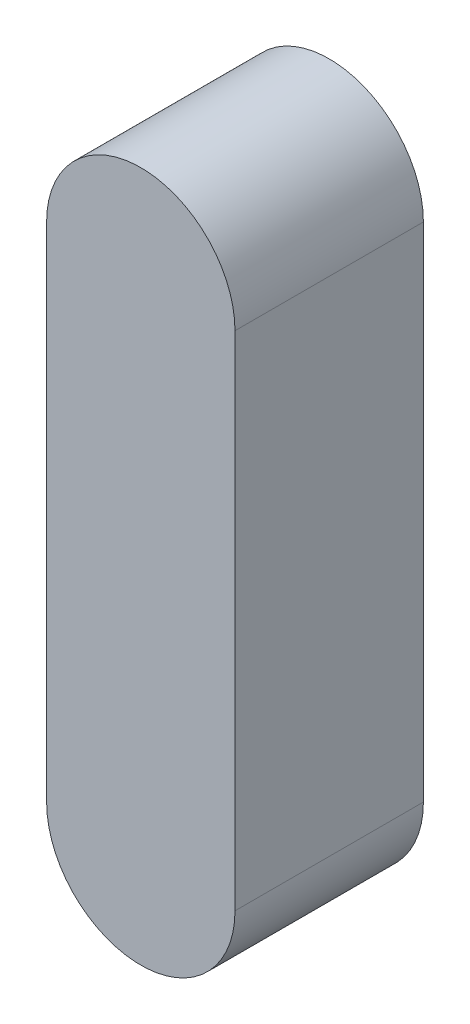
from build123d import *

# Parameters (mm, degrees)
BASE_EXTRUDE_DEPTH = 3


with BuildPart() as part:
    # Sketch1 → Base-Extrude (new body)
    with BuildSketch(Plane.XY):
        with BuildLine():
            Line((1.5, 8), (1.5, 0))
            ThreePointArc((1.5, 0), (0, -1.5), (-1.5, 0))
            Line((-1.5, 0), (-1.5, 8))
            ThreePointArc((-1.5, 8), (0, 9.5), (1.5, 8))
        make_face()
    extrude(amount=BASE_EXTRUDE_DEPTH)


solid = part.part
